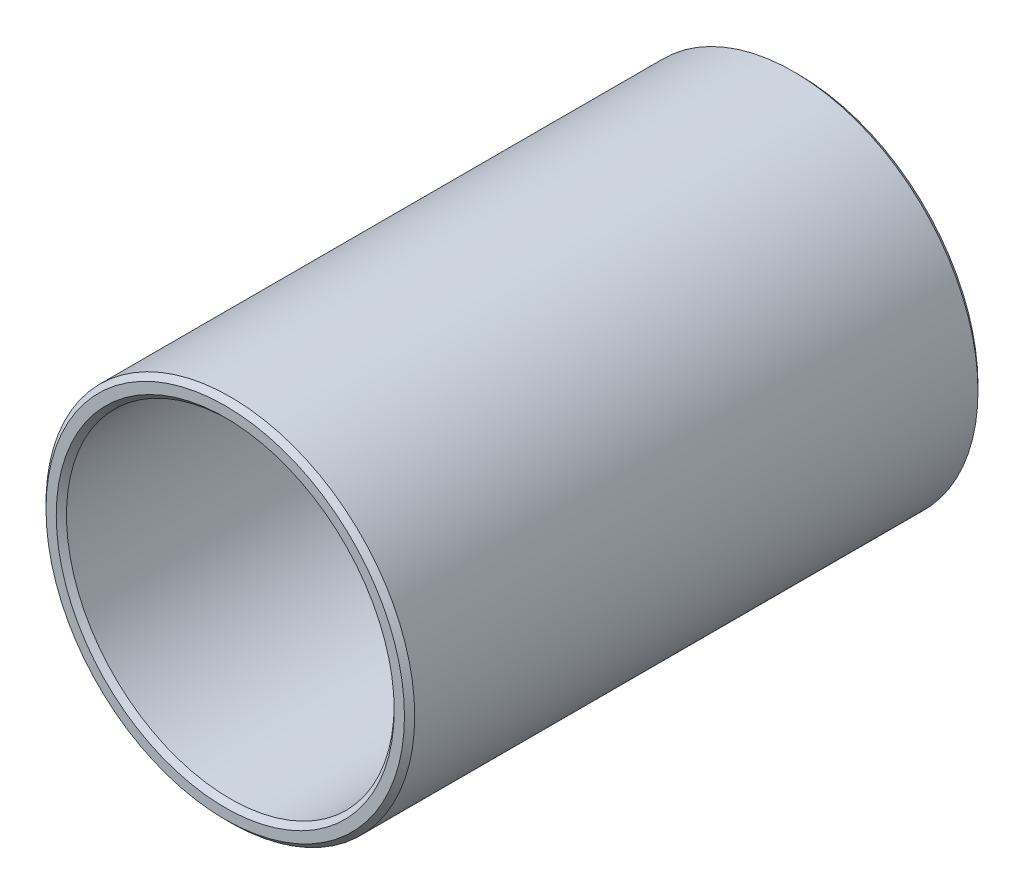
ISO-10303-21;
HEADER;
FILE_DESCRIPTION(('STEP AP214'),'2;1');
FILE_NAME('part.step','',(''),(''),'','','');
FILE_SCHEMA(('AUTOMOTIVE_DESIGN { 1 0 10303 214 1 1 1 1 }'));
ENDSEC;
DATA;
#1=APPLICATION_CONTEXT('core data for automotive mechanical design processes');
#2=APPLICATION_PROTOCOL_DEFINITION('international standard','automotive_design',2000,#1);
#3=PRODUCT_CONTEXT('',#1,'mechanical');
#4=PRODUCT('Part','Part','',(#3));
#5=PRODUCT_RELATED_PRODUCT_CATEGORY('part','',(#4));
#6=PRODUCT_DEFINITION_FORMATION('','',#4);
#7=PRODUCT_DEFINITION_CONTEXT('part definition',#1,'design');
#8=PRODUCT_DEFINITION('design','',#6,#7);
#9=PRODUCT_DEFINITION_SHAPE('','',#8);
#10=(LENGTH_UNIT() NAMED_UNIT(*) SI_UNIT(.MILLI.,.METRE.));
#11=(NAMED_UNIT(*) PLANE_ANGLE_UNIT() SI_UNIT($,.RADIAN.));
#12=(NAMED_UNIT(*) SI_UNIT($,.STERADIAN.) SOLID_ANGLE_UNIT());
#13=UNCERTAINTY_MEASURE_WITH_UNIT(LENGTH_MEASURE(1.E-05),#10,'distance_accuracy_value','');
#14=(GEOMETRIC_REPRESENTATION_CONTEXT(3) GLOBAL_UNCERTAINTY_ASSIGNED_CONTEXT((#13)) GLOBAL_UNIT_ASSIGNED_CONTEXT((#10,
#11,#12)) REPRESENTATION_CONTEXT('',''));
#15=CARTESIAN_POINT('',(0.,0.,0.));
#16=DIRECTION('',(0.,0.,1.));
#17=DIRECTION('',(1.,0.,0.));
#18=AXIS2_PLACEMENT_3D('',#15,#16,#17);
#19=CARTESIAN_POINT('',(0.,0.,56.));
#20=DIRECTION('',(0.,0.,1.));
#21=DIRECTION('',(1.,0.,0.));
#22=AXIS2_PLACEMENT_3D('',#19,#20,#21);
#23=PLANE('',#22);
#24=CARTESIAN_POINT('',(0.,0.,56.));
#25=DIRECTION('',(0.,0.,1.));
#26=DIRECTION('',(1.,0.,0.));
#27=AXIS2_PLACEMENT_3D('',#24,#25,#26);
#28=CIRCLE('',#27,16.5);
#29=CARTESIAN_POINT('',(16.5,0.,56.));
#30=VERTEX_POINT('',#29);
#31=EDGE_CURVE('E56',#30,#30,#28,.F.);
#32=ORIENTED_EDGE('',*,*,#31,.T.);
#33=EDGE_LOOP('',(#32));
#34=FACE_BOUND('',#33,.T.);
#35=CARTESIAN_POINT('',(0.,0.,56.));
#36=DIRECTION('',(0.,0.,1.));
#37=DIRECTION('',(1.,0.,0.));
#38=AXIS2_PLACEMENT_3D('',#35,#36,#37);
#39=CIRCLE('',#38,17.5);
#40=CARTESIAN_POINT('',(17.5,0.,56.));
#41=VERTEX_POINT('',#40);
#42=EDGE_CURVE('E59',#41,#41,#39,.T.);
#43=ORIENTED_EDGE('',*,*,#42,.T.);
#44=EDGE_LOOP('',(#43));
#45=FACE_BOUND('',#44,.T.);
#46=ADVANCED_FACE('F33',(#34,#45),#23,.T.);
#47=CARTESIAN_POINT('',(0.,0.,0.));
#48=DIRECTION('',(0.,0.,1.));
#49=DIRECTION('',(1.,0.,0.));
#50=AXIS2_PLACEMENT_3D('',#47,#48,#49);
#51=PLANE('',#50);
#52=CARTESIAN_POINT('',(0.,0.,0.));
#53=DIRECTION('',(0.,0.,1.));
#54=DIRECTION('',(1.,0.,0.));
#55=AXIS2_PLACEMENT_3D('',#52,#53,#54);
#56=CIRCLE('',#55,16.5);
#57=CARTESIAN_POINT('',(16.5,0.,0.));
#58=VERTEX_POINT('',#57);
#59=EDGE_CURVE('E44',#58,#58,#56,.T.);
#60=ORIENTED_EDGE('',*,*,#59,.T.);
#61=EDGE_LOOP('',(#60));
#62=FACE_BOUND('',#61,.T.);
#63=CARTESIAN_POINT('',(0.,0.,0.));
#64=DIRECTION('',(0.,0.,1.));
#65=DIRECTION('',(1.,0.,0.));
#66=AXIS2_PLACEMENT_3D('',#63,#64,#65);
#67=CIRCLE('',#66,17.5);
#68=CARTESIAN_POINT('',(17.5,0.,0.));
#69=VERTEX_POINT('',#68);
#70=EDGE_CURVE('E48',#69,#69,#67,.F.);
#71=ORIENTED_EDGE('',*,*,#70,.T.);
#72=EDGE_LOOP('',(#71));
#73=FACE_BOUND('',#72,.T.);
#74=ADVANCED_FACE('F83',(#62,#73),#51,.F.);
#75=CARTESIAN_POINT('',(0.,0.,56.));
#76=DIRECTION('',(0.,0.,-1.));
#77=DIRECTION('',(-1.,0.,0.));
#78=AXIS2_PLACEMENT_3D('',#75,#76,#77);
#79=CYLINDRICAL_SURFACE('',#78,18.);
#80=CARTESIAN_POINT('',(0.,0.,0.500000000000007));
#81=DIRECTION('',(0.,0.,1.));
#82=DIRECTION('',(1.,0.,0.));
#83=AXIS2_PLACEMENT_3D('',#80,#81,#82);
#84=CIRCLE('',#83,18.);
#85=CARTESIAN_POINT('',(18.,0.,0.500000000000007));
#86=VERTEX_POINT('',#85);
#87=EDGE_CURVE('E10',#86,#86,#84,.T.);
#88=ORIENTED_EDGE('',*,*,#87,.T.);
#89=EDGE_LOOP('',(#88));
#90=FACE_BOUND('',#89,.T.);
#91=CARTESIAN_POINT('',(0.,0.,55.5));
#92=DIRECTION('',(0.,0.,1.));
#93=DIRECTION('',(1.,0.,0.));
#94=AXIS2_PLACEMENT_3D('',#91,#92,#93);
#95=CIRCLE('',#94,18.);
#96=CARTESIAN_POINT('',(18.,0.,55.5));
#97=VERTEX_POINT('',#96);
#98=EDGE_CURVE('E53',#97,#97,#95,.F.);
#99=ORIENTED_EDGE('',*,*,#98,.T.);
#100=EDGE_LOOP('',(#99));
#101=FACE_BOUND('',#100,.T.);
#102=ADVANCED_FACE('F35',(#90,#101),#79,.T.);
#103=CARTESIAN_POINT('',(0.,0.,56.));
#104=DIRECTION('',(0.,0.,-1.));
#105=DIRECTION('',(-1.,0.,0.));
#106=AXIS2_PLACEMENT_3D('',#103,#104,#105);
#107=CYLINDRICAL_SURFACE('',#106,16.);
#108=CARTESIAN_POINT('',(0.,0.,0.500000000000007));
#109=DIRECTION('',(0.,0.,1.));
#110=DIRECTION('',(1.,0.,0.));
#111=AXIS2_PLACEMENT_3D('',#108,#109,#110);
#112=CIRCLE('',#111,16.);
#113=CARTESIAN_POINT('',(16.,0.,0.500000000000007));
#114=VERTEX_POINT('',#113);
#115=EDGE_CURVE('E40',#114,#114,#112,.F.);
#116=ORIENTED_EDGE('',*,*,#115,.T.);
#117=EDGE_LOOP('',(#116));
#118=FACE_BOUND('',#117,.T.);
#119=CARTESIAN_POINT('',(0.,0.,55.5));
#120=DIRECTION('',(0.,0.,1.));
#121=DIRECTION('',(1.,0.,0.));
#122=AXIS2_PLACEMENT_3D('',#119,#120,#121);
#123=CIRCLE('',#122,16.);
#124=CARTESIAN_POINT('',(16.,0.,55.5));
#125=VERTEX_POINT('',#124);
#126=EDGE_CURVE('E62',#125,#125,#123,.T.);
#127=ORIENTED_EDGE('',*,*,#126,.T.);
#128=EDGE_LOOP('',(#127));
#129=FACE_BOUND('',#128,.T.);
#130=ADVANCED_FACE('F66',(#118,#129),#107,.F.);
#131=CARTESIAN_POINT('',(0.,0.,55.5));
#132=DIRECTION('',(0.,0.,1.));
#133=DIRECTION('',(1.,0.,0.));
#134=AXIS2_PLACEMENT_3D('',#131,#132,#133);
#135=CONICAL_SURFACE('',#134,16.,0.785398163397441);
#136=ORIENTED_EDGE('',*,*,#31,.F.);
#137=EDGE_LOOP('',(#136));
#138=FACE_BOUND('',#137,.T.);
#139=ORIENTED_EDGE('',*,*,#126,.F.);
#140=EDGE_LOOP('',(#139));
#141=FACE_BOUND('',#140,.T.);
#142=ADVANCED_FACE('F68',(#138,#141),#135,.F.);
#143=CARTESIAN_POINT('',(0.,0.,56.));
#144=DIRECTION('',(0.,0.,-1.));
#145=DIRECTION('',(-1.,0.,0.));
#146=AXIS2_PLACEMENT_3D('',#143,#144,#145);
#147=CONICAL_SURFACE('',#146,17.5,0.785398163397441);
#148=ORIENTED_EDGE('',*,*,#98,.F.);
#149=EDGE_LOOP('',(#148));
#150=FACE_BOUND('',#149,.T.);
#151=ORIENTED_EDGE('',*,*,#42,.F.);
#152=EDGE_LOOP('',(#151));
#153=FACE_BOUND('',#152,.T.);
#154=ADVANCED_FACE('F70',(#150,#153),#147,.T.);
#155=CARTESIAN_POINT('',(0.,0.,0.));
#156=DIRECTION('',(0.,0.,-1.));
#157=DIRECTION('',(-1.,0.,0.));
#158=AXIS2_PLACEMENT_3D('',#155,#156,#157);
#159=CONICAL_SURFACE('',#158,16.5,0.785398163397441);
#160=ORIENTED_EDGE('',*,*,#115,.F.);
#161=EDGE_LOOP('',(#160));
#162=FACE_BOUND('',#161,.T.);
#163=ORIENTED_EDGE('',*,*,#59,.F.);
#164=EDGE_LOOP('',(#163));
#165=FACE_BOUND('',#164,.T.);
#166=ADVANCED_FACE('F77',(#162,#165),#159,.F.);
#167=CARTESIAN_POINT('',(0.,0.,0.500000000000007));
#168=DIRECTION('',(0.,0.,1.));
#169=DIRECTION('',(1.,0.,0.));
#170=AXIS2_PLACEMENT_3D('',#167,#168,#169);
#171=CONICAL_SURFACE('',#170,18.,0.785398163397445);
#172=ORIENTED_EDGE('',*,*,#70,.F.);
#173=EDGE_LOOP('',(#172));
#174=FACE_BOUND('',#173,.T.);
#175=ORIENTED_EDGE('',*,*,#87,.F.);
#176=EDGE_LOOP('',(#175));
#177=FACE_BOUND('',#176,.T.);
#178=ADVANCED_FACE('F100',(#174,#177),#171,.T.);
#179=CLOSED_SHELL('',(#46,#74,#102,#130,#142,#154,#166,#178));
#180=MANIFOLD_SOLID_BREP('B2',#179);
#181=ADVANCED_BREP_SHAPE_REPRESENTATION('',(#18,#180),#14);
#182=SHAPE_DEFINITION_REPRESENTATION(#9,#181);
ENDSEC;
END-ISO-10303-21;
